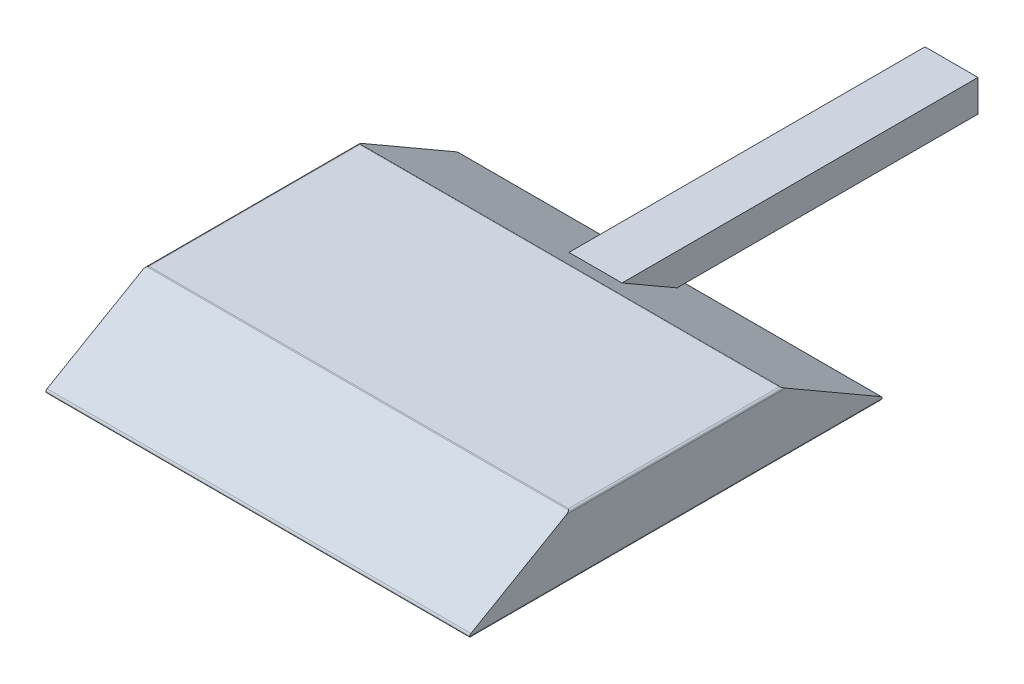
from build123d import *

# Parameters (mm, degrees)
BOSS_EXTRUDE1_DEPTH = 25.4
SKETCH2_W           = 6.35
SKETCH2_H           = 3.81
BOSS_EXTRUDE2_DEPTH = 45.72
FILLET1_R           = 0.254


with BuildPart() as part:
    # Sketch1 → Boss-Extrude1 (new, symmetric)
    with BuildSketch(Plane(origin=(0, 0, 0), x_dir=(0, 0, -1), z_dir=(1, 0, 0))):
        Polygon((25.4, -3.666174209), (-25.4, -3.666174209), (-12.7, 3.666174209), (12.7, 3.666174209), align=None)
    extrude(amount=BOSS_EXTRUDE1_DEPTH, both=True)

    # Sketch2 → Boss-Extrude2 (add)
    with BuildSketch(Plane(origin=(0, 0, -12.7), x_dir=(-1, 0, 0), z_dir=(0, 0, -1))):
        Rectangle(SKETCH2_W, SKETCH2_H)
    extrude(amount=BOSS_EXTRUDE2_DEPTH)

    # Fillet1
    fillet1_edges = [part.edges().sort_by_distance(p)[0] for p in [
        (25.4, -3.666174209, 0),
        (-25.4, -3.666174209, 0),
        (-25.4, 3.666174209, 0),
        (0, -3.666174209, -25.4),
        (0, -3.666174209, 25.4),
        (0, 3.666174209, 12.7),
        (0, 3.666174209, -12.7),
        (25.4, 3.666174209, 0),
    ]]
    fillet(fillet1_edges, radius=FILLET1_R)


solid = part.part
